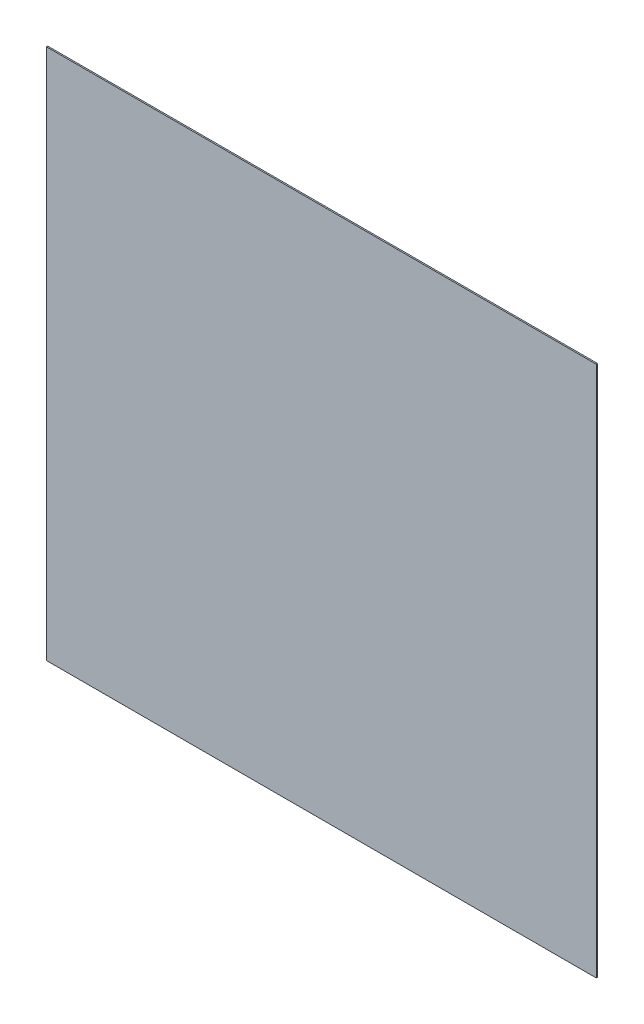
ISO-10303-21;
HEADER;
FILE_DESCRIPTION(('STEP AP214'),'2;1');
FILE_NAME('part.step','',(''),(''),'','','');
FILE_SCHEMA(('AUTOMOTIVE_DESIGN { 1 0 10303 214 1 1 1 1 }'));
ENDSEC;
DATA;
#1=APPLICATION_CONTEXT('core data for automotive mechanical design processes');
#2=APPLICATION_PROTOCOL_DEFINITION('international standard','automotive_design',2000,#1);
#3=PRODUCT_CONTEXT('',#1,'mechanical');
#4=PRODUCT('Part','Part','',(#3));
#5=PRODUCT_RELATED_PRODUCT_CATEGORY('part','',(#4));
#6=PRODUCT_DEFINITION_FORMATION('','',#4);
#7=PRODUCT_DEFINITION_CONTEXT('part definition',#1,'design');
#8=PRODUCT_DEFINITION('design','',#6,#7);
#9=PRODUCT_DEFINITION_SHAPE('','',#8);
#10=(LENGTH_UNIT() NAMED_UNIT(*) SI_UNIT(.MILLI.,.METRE.));
#11=(NAMED_UNIT(*) PLANE_ANGLE_UNIT() SI_UNIT($,.RADIAN.));
#12=(NAMED_UNIT(*) SI_UNIT($,.STERADIAN.) SOLID_ANGLE_UNIT());
#13=UNCERTAINTY_MEASURE_WITH_UNIT(LENGTH_MEASURE(1.E-05),#10,'distance_accuracy_value','');
#14=(GEOMETRIC_REPRESENTATION_CONTEXT(3) GLOBAL_UNCERTAINTY_ASSIGNED_CONTEXT((#13)) GLOBAL_UNIT_ASSIGNED_CONTEXT((#10,
#11,#12)) REPRESENTATION_CONTEXT('',''));
#15=CARTESIAN_POINT('',(0.,0.,0.));
#16=DIRECTION('',(0.,0.,1.));
#17=DIRECTION('',(1.,0.,0.));
#18=AXIS2_PLACEMENT_3D('',#15,#16,#17);
#19=CARTESIAN_POINT('',(813.14332264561,211.803477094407,0.5));
#20=DIRECTION('',(0.,1.,0.));
#21=DIRECTION('',(0.,0.,1.));
#22=AXIS2_PLACEMENT_3D('',#19,#20,#21);
#23=PLANE('',#22);
#24=DIRECTION('',(1.,0.,0.));
#25=VECTOR('',#24,1.);
#26=CARTESIAN_POINT('',(813.14332264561,211.803477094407,0.5));
#27=LINE('',#26,#25);
#28=CARTESIAN_POINT('',(814.14332264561,211.803477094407,0.5));
#29=VERTEX_POINT('',#28);
#30=CARTESIAN_POINT('',(1023.14332264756,211.803477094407,0.5));
#31=VERTEX_POINT('',#30);
#32=EDGE_CURVE('E91',#29,#31,#27,.T.);
#33=ORIENTED_EDGE('',*,*,#32,.F.);
#34=DIRECTION('',(0.,0.,-1.));
#35=VECTOR('',#34,1.);
#36=CARTESIAN_POINT('',(814.14332264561,211.803477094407,0.5));
#37=LINE('',#36,#35);
#38=CARTESIAN_POINT('',(814.14332264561,211.803477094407,0.));
#39=VERTEX_POINT('',#38);
#40=EDGE_CURVE('E96',#29,#39,#37,.T.);
#41=ORIENTED_EDGE('',*,*,#40,.T.);
#42=DIRECTION('',(1.,0.,0.));
#43=VECTOR('',#42,1.);
#44=CARTESIAN_POINT('',(813.14332264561,211.803477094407,0.));
#45=LINE('',#44,#43);
#46=CARTESIAN_POINT('',(1023.14332264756,211.803477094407,0.));
#47=VERTEX_POINT('',#46);
#48=EDGE_CURVE('E83',#39,#47,#45,.T.);
#49=ORIENTED_EDGE('',*,*,#48,.T.);
#50=DIRECTION('',(0.,0.,-1.));
#51=VECTOR('',#50,1.);
#52=CARTESIAN_POINT('',(1023.14332264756,211.803477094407,0.5));
#53=LINE('',#52,#51);
#54=EDGE_CURVE('E45',#31,#47,#53,.T.);
#55=ORIENTED_EDGE('',*,*,#54,.F.);
#56=EDGE_LOOP('',(#33,#41,#49,#55));
#57=FACE_BOUND('',#56,.T.);
#58=ADVANCED_FACE('F38',(#57),#23,.F.);
#59=CARTESIAN_POINT('',(1023.14332264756,211.803477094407,0.5));
#60=DIRECTION('',(-1.,0.,0.));
#61=DIRECTION('',(0.,0.,1.));
#62=AXIS2_PLACEMENT_3D('',#59,#60,#61);
#63=PLANE('',#62);
#64=DIRECTION('',(0.,1.,0.));
#65=VECTOR('',#64,1.);
#66=CARTESIAN_POINT('',(1023.14332264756,211.803477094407,0.));
#67=LINE('',#66,#65);
#68=CARTESIAN_POINT('',(1023.14332264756,413.803477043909,0.));
#69=VERTEX_POINT('',#68);
#70=EDGE_CURVE('E73',#47,#69,#67,.T.);
#71=ORIENTED_EDGE('',*,*,#70,.T.);
#72=DIRECTION('',(0.,0.,-1.));
#73=VECTOR('',#72,1.);
#74=CARTESIAN_POINT('',(1023.14332264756,413.803477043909,0.5));
#75=LINE('',#74,#73);
#76=CARTESIAN_POINT('',(1023.14332264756,413.803477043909,0.5));
#77=VERTEX_POINT('',#76);
#78=EDGE_CURVE('E76',#77,#69,#75,.T.);
#79=ORIENTED_EDGE('',*,*,#78,.F.);
#80=DIRECTION('',(0.,1.,0.));
#81=VECTOR('',#80,1.);
#82=CARTESIAN_POINT('',(1023.14332264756,211.803477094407,0.5));
#83=LINE('',#82,#81);
#84=EDGE_CURVE('E60',#31,#77,#83,.T.);
#85=ORIENTED_EDGE('',*,*,#84,.F.);
#86=ORIENTED_EDGE('',*,*,#54,.T.);
#87=EDGE_LOOP('',(#71,#79,#85,#86));
#88=FACE_BOUND('',#87,.T.);
#89=ADVANCED_FACE('F75',(#88),#63,.F.);
#90=CARTESIAN_POINT('',(1023.14332264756,413.803477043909,0.5));
#91=DIRECTION('',(0.,-1.,0.));
#92=DIRECTION('',(0.,0.,-1.));
#93=AXIS2_PLACEMENT_3D('',#90,#91,#92);
#94=PLANE('',#93);
#95=DIRECTION('',(-1.,0.,0.));
#96=VECTOR('',#95,1.);
#97=CARTESIAN_POINT('',(1023.14332264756,413.803477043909,0.));
#98=LINE('',#97,#96);
#99=CARTESIAN_POINT('',(814.14332264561,413.803477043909,0.));
#100=VERTEX_POINT('',#99);
#101=EDGE_CURVE('E82',#69,#100,#98,.T.);
#102=ORIENTED_EDGE('',*,*,#101,.T.);
#103=DIRECTION('',(0.,0.,1.));
#104=VECTOR('',#103,1.);
#105=CARTESIAN_POINT('',(814.14332264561,413.803477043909,0.5));
#106=LINE('',#105,#104);
#107=CARTESIAN_POINT('',(814.14332264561,413.803477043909,0.5));
#108=VERTEX_POINT('',#107);
#109=EDGE_CURVE('E52',#100,#108,#106,.T.);
#110=ORIENTED_EDGE('',*,*,#109,.T.);
#111=DIRECTION('',(-1.,0.,0.));
#112=VECTOR('',#111,1.);
#113=CARTESIAN_POINT('',(1023.14332264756,413.803477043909,0.5));
#114=LINE('',#113,#112);
#115=EDGE_CURVE('E88',#77,#108,#114,.T.);
#116=ORIENTED_EDGE('',*,*,#115,.F.);
#117=ORIENTED_EDGE('',*,*,#78,.T.);
#118=EDGE_LOOP('',(#102,#110,#116,#117));
#119=FACE_BOUND('',#118,.T.);
#120=ADVANCED_FACE('F87',(#119),#94,.F.);
#121=CARTESIAN_POINT('',(0.,0.,0.5));
#122=DIRECTION('',(0.,0.,1.));
#123=DIRECTION('',(1.,0.,0.));
#124=AXIS2_PLACEMENT_3D('',#121,#122,#123);
#125=PLANE('',#124);
#126=DIRECTION('',(0.,1.,0.));
#127=VECTOR('',#126,1.);
#128=CARTESIAN_POINT('',(814.14332264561,419.818792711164,0.5));
#129=LINE('',#128,#127);
#130=EDGE_CURVE('E102',#29,#108,#129,.T.);
#131=ORIENTED_EDGE('',*,*,#130,.F.);
#132=ORIENTED_EDGE('',*,*,#32,.T.);
#133=ORIENTED_EDGE('',*,*,#84,.T.);
#134=ORIENTED_EDGE('',*,*,#115,.T.);
#135=EDGE_LOOP('',(#131,#132,#133,#134));
#136=FACE_BOUND('',#135,.T.);
#137=ADVANCED_FACE('F110',(#136),#125,.T.);
#138=CARTESIAN_POINT('',(0.,0.,0.));
#139=DIRECTION('',(0.,0.,1.));
#140=DIRECTION('',(1.,0.,0.));
#141=AXIS2_PLACEMENT_3D('',#138,#139,#140);
#142=PLANE('',#141);
#143=ORIENTED_EDGE('',*,*,#48,.F.);
#144=DIRECTION('',(0.,1.,0.));
#145=VECTOR('',#144,1.);
#146=CARTESIAN_POINT('',(814.14332264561,0.,0.));
#147=LINE('',#146,#145);
#148=EDGE_CURVE('E11',#39,#100,#147,.T.);
#149=ORIENTED_EDGE('',*,*,#148,.T.);
#150=ORIENTED_EDGE('',*,*,#101,.F.);
#151=ORIENTED_EDGE('',*,*,#70,.F.);
#152=EDGE_LOOP('',(#143,#149,#150,#151));
#153=FACE_BOUND('',#152,.T.);
#154=ADVANCED_FACE('F90',(#153),#142,.F.);
#155=CARTESIAN_POINT('',(814.14332264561,419.818792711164,0.));
#156=DIRECTION('',(1.,0.,0.));
#157=DIRECTION('',(0.,0.,-1.));
#158=AXIS2_PLACEMENT_3D('',#155,#156,#157);
#159=PLANE('',#158);
#160=ORIENTED_EDGE('',*,*,#130,.T.);
#161=ORIENTED_EDGE('',*,*,#109,.F.);
#162=ORIENTED_EDGE('',*,*,#148,.F.);
#163=ORIENTED_EDGE('',*,*,#40,.F.);
#164=EDGE_LOOP('',(#160,#161,#162,#163));
#165=FACE_BOUND('',#164,.T.);
#166=ADVANCED_FACE('F106',(#165),#159,.F.);
#167=CLOSED_SHELL('',(#58,#89,#120,#137,#154,#166));
#168=MANIFOLD_SOLID_BREP('B2',#167);
#169=ADVANCED_BREP_SHAPE_REPRESENTATION('',(#18,#168),#14);
#170=SHAPE_DEFINITION_REPRESENTATION(#9,#169);
ENDSEC;
END-ISO-10303-21;
